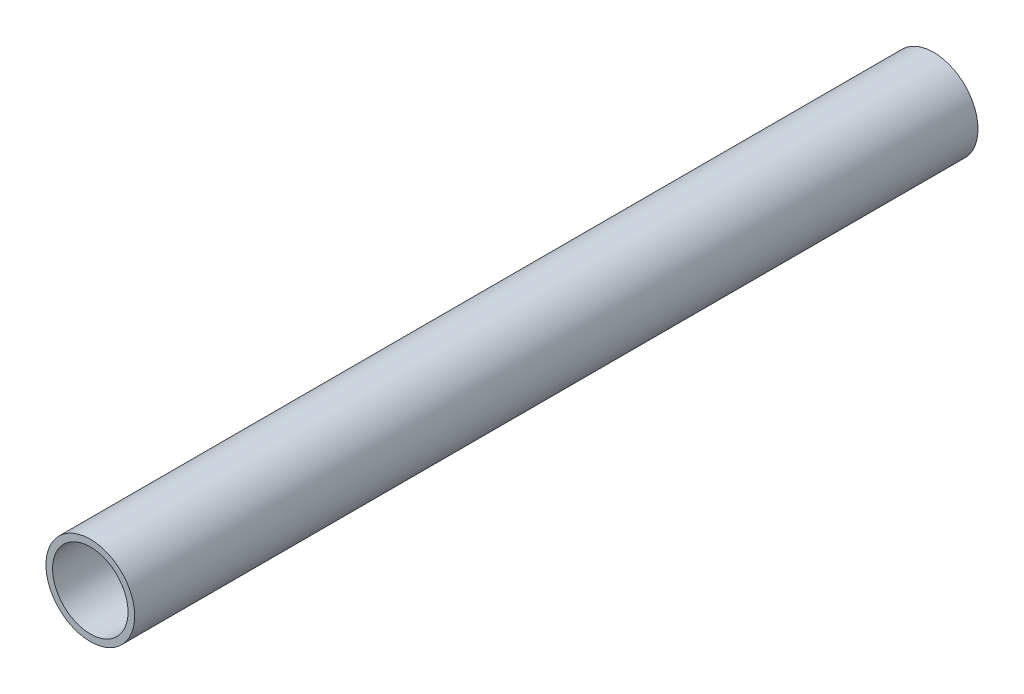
ISO-10303-21;
HEADER;
FILE_DESCRIPTION(('STEP AP214'),'2;1');
FILE_NAME('part.step','',(''),(''),'','','');
FILE_SCHEMA(('AUTOMOTIVE_DESIGN { 1 0 10303 214 1 1 1 1 }'));
ENDSEC;
DATA;
#1=APPLICATION_CONTEXT('core data for automotive mechanical design processes');
#2=APPLICATION_PROTOCOL_DEFINITION('international standard','automotive_design',2000,#1);
#3=PRODUCT_CONTEXT('',#1,'mechanical');
#4=PRODUCT('Part','Part','',(#3));
#5=PRODUCT_RELATED_PRODUCT_CATEGORY('part','',(#4));
#6=PRODUCT_DEFINITION_FORMATION('','',#4);
#7=PRODUCT_DEFINITION_CONTEXT('part definition',#1,'design');
#8=PRODUCT_DEFINITION('design','',#6,#7);
#9=PRODUCT_DEFINITION_SHAPE('','',#8);
#10=(LENGTH_UNIT() NAMED_UNIT(*) SI_UNIT(.MILLI.,.METRE.));
#11=(NAMED_UNIT(*) PLANE_ANGLE_UNIT() SI_UNIT($,.RADIAN.));
#12=(NAMED_UNIT(*) SI_UNIT($,.STERADIAN.) SOLID_ANGLE_UNIT());
#13=UNCERTAINTY_MEASURE_WITH_UNIT(LENGTH_MEASURE(1.E-05),#10,'distance_accuracy_value','');
#14=(GEOMETRIC_REPRESENTATION_CONTEXT(3) GLOBAL_UNCERTAINTY_ASSIGNED_CONTEXT((#13)) GLOBAL_UNIT_ASSIGNED_CONTEXT((#10,
#11,#12)) REPRESENTATION_CONTEXT('',''));
#15=CARTESIAN_POINT('',(0.,0.,0.));
#16=DIRECTION('',(0.,0.,1.));
#17=DIRECTION('',(1.,0.,0.));
#18=AXIS2_PLACEMENT_3D('',#15,#16,#17);
#19=CARTESIAN_POINT('',(0.,0.,380.));
#20=DIRECTION('',(0.,0.,1.));
#21=DIRECTION('',(1.,0.,0.));
#22=AXIS2_PLACEMENT_3D('',#19,#20,#21);
#23=PLANE('',#22);
#24=CARTESIAN_POINT('',(0.,0.,380.));
#25=DIRECTION('',(0.,0.,1.));
#26=DIRECTION('',(1.,0.,0.));
#27=AXIS2_PLACEMENT_3D('',#24,#25,#26);
#28=CIRCLE('',#27,20.);
#29=CARTESIAN_POINT('',(20.,0.,380.));
#30=VERTEX_POINT('',#29);
#31=EDGE_CURVE('E10',#30,#30,#28,.T.);
#32=ORIENTED_EDGE('',*,*,#31,.T.);
#33=EDGE_LOOP('',(#32));
#34=FACE_BOUND('',#33,.T.);
#35=CARTESIAN_POINT('',(0.,0.,380.));
#36=DIRECTION('',(0.,0.,1.));
#37=DIRECTION('',(1.,0.,0.));
#38=AXIS2_PLACEMENT_3D('',#35,#36,#37);
#39=CIRCLE('',#38,17.);
#40=CARTESIAN_POINT('',(17.,0.,380.));
#41=VERTEX_POINT('',#40);
#42=EDGE_CURVE('E41',#41,#41,#39,.T.);
#43=ORIENTED_EDGE('',*,*,#42,.F.);
#44=EDGE_LOOP('',(#43));
#45=FACE_BOUND('',#44,.T.);
#46=ADVANCED_FACE('F30',(#34,#45),#23,.T.);
#47=CARTESIAN_POINT('',(0.,0.,0.));
#48=DIRECTION('',(0.,0.,1.));
#49=DIRECTION('',(1.,0.,0.));
#50=AXIS2_PLACEMENT_3D('',#47,#48,#49);
#51=PLANE('',#50);
#52=CARTESIAN_POINT('',(0.,0.,0.));
#53=DIRECTION('',(0.,0.,1.));
#54=DIRECTION('',(1.,0.,0.));
#55=AXIS2_PLACEMENT_3D('',#52,#53,#54);
#56=CIRCLE('',#55,20.);
#57=CARTESIAN_POINT('',(20.,0.,0.));
#58=VERTEX_POINT('',#57);
#59=EDGE_CURVE('E34',#58,#58,#56,.T.);
#60=ORIENTED_EDGE('',*,*,#59,.F.);
#61=EDGE_LOOP('',(#60));
#62=FACE_BOUND('',#61,.T.);
#63=CARTESIAN_POINT('',(0.,0.,0.));
#64=DIRECTION('',(0.,0.,1.));
#65=DIRECTION('',(1.,0.,0.));
#66=AXIS2_PLACEMENT_3D('',#63,#64,#65);
#67=CIRCLE('',#66,17.);
#68=CARTESIAN_POINT('',(17.,0.,0.));
#69=VERTEX_POINT('',#68);
#70=EDGE_CURVE('E43',#69,#69,#67,.T.);
#71=ORIENTED_EDGE('',*,*,#70,.T.);
#72=EDGE_LOOP('',(#71));
#73=FACE_BOUND('',#72,.T.);
#74=ADVANCED_FACE('F53',(#62,#73),#51,.F.);
#75=CARTESIAN_POINT('',(0.,0.,380.));
#76=DIRECTION('',(0.,0.,-1.));
#77=DIRECTION('',(-1.,0.,0.));
#78=AXIS2_PLACEMENT_3D('',#75,#76,#77);
#79=CYLINDRICAL_SURFACE('',#78,20.);
#80=ORIENTED_EDGE('',*,*,#31,.F.);
#81=EDGE_LOOP('',(#80));
#82=FACE_BOUND('',#81,.T.);
#83=ORIENTED_EDGE('',*,*,#59,.T.);
#84=EDGE_LOOP('',(#83));
#85=FACE_BOUND('',#84,.T.);
#86=ADVANCED_FACE('F32',(#82,#85),#79,.T.);
#87=CARTESIAN_POINT('',(0.,0.,380.));
#88=DIRECTION('',(0.,0.,-1.));
#89=DIRECTION('',(-1.,0.,0.));
#90=AXIS2_PLACEMENT_3D('',#87,#88,#89);
#91=CYLINDRICAL_SURFACE('',#90,17.);
#92=ORIENTED_EDGE('',*,*,#42,.T.);
#93=EDGE_LOOP('',(#92));
#94=FACE_BOUND('',#93,.T.);
#95=ORIENTED_EDGE('',*,*,#70,.F.);
#96=EDGE_LOOP('',(#95));
#97=FACE_BOUND('',#96,.T.);
#98=ADVANCED_FACE('F49',(#94,#97),#91,.F.);
#99=CLOSED_SHELL('',(#46,#74,#86,#98));
#100=MANIFOLD_SOLID_BREP('B2',#99);
#101=ADVANCED_BREP_SHAPE_REPRESENTATION('',(#18,#100),#14);
#102=SHAPE_DEFINITION_REPRESENTATION(#9,#101);
ENDSEC;
END-ISO-10303-21;
